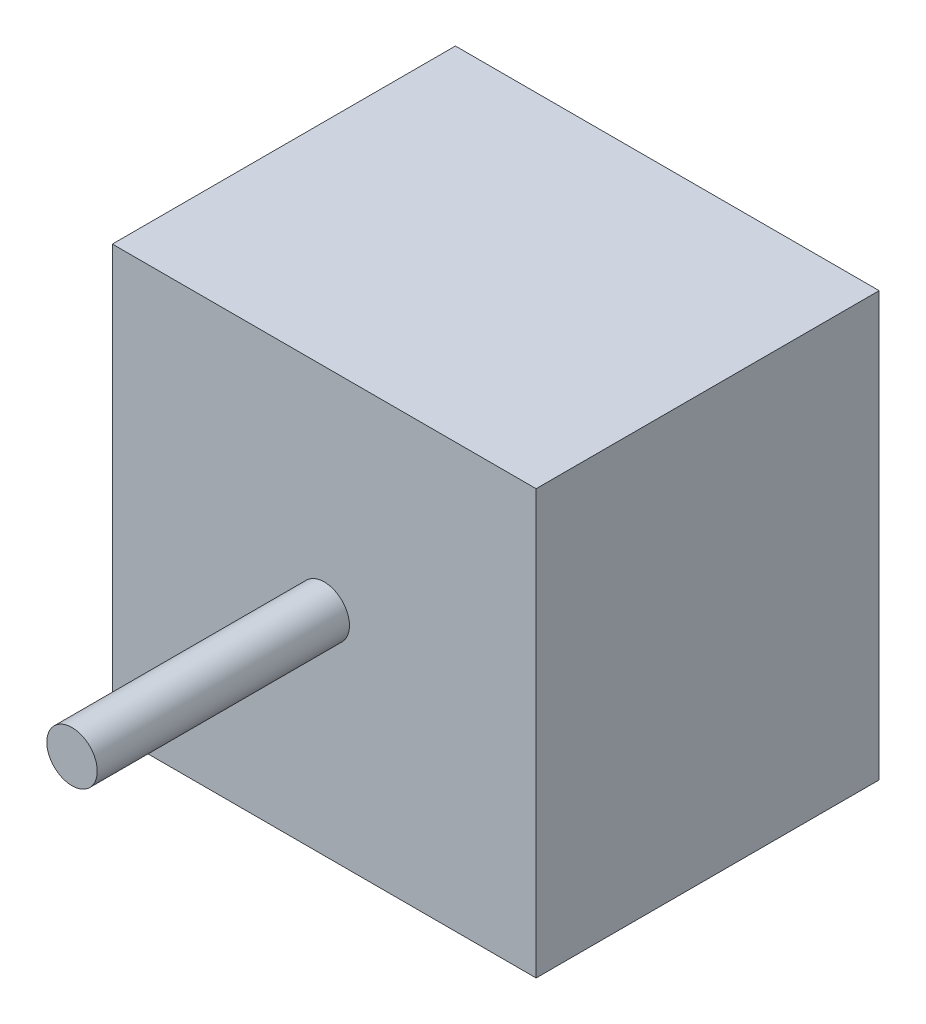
ISO-10303-21;
HEADER;
FILE_DESCRIPTION(('STEP AP214'),'2;1');
FILE_NAME('part.step','',(''),(''),'','','');
FILE_SCHEMA(('AUTOMOTIVE_DESIGN { 1 0 10303 214 1 1 1 1 }'));
ENDSEC;
DATA;
#1=APPLICATION_CONTEXT('core data for automotive mechanical design processes');
#2=APPLICATION_PROTOCOL_DEFINITION('international standard','automotive_design',2000,#1);
#3=PRODUCT_CONTEXT('',#1,'mechanical');
#4=PRODUCT('Part','Part','',(#3));
#5=PRODUCT_RELATED_PRODUCT_CATEGORY('part','',(#4));
#6=PRODUCT_DEFINITION_FORMATION('','',#4);
#7=PRODUCT_DEFINITION_CONTEXT('part definition',#1,'design');
#8=PRODUCT_DEFINITION('design','',#6,#7);
#9=PRODUCT_DEFINITION_SHAPE('','',#8);
#10=(LENGTH_UNIT() NAMED_UNIT(*) SI_UNIT(.MILLI.,.METRE.));
#11=(NAMED_UNIT(*) PLANE_ANGLE_UNIT() SI_UNIT($,.RADIAN.));
#12=(NAMED_UNIT(*) SI_UNIT($,.STERADIAN.) SOLID_ANGLE_UNIT());
#13=UNCERTAINTY_MEASURE_WITH_UNIT(LENGTH_MEASURE(1.E-05),#10,'distance_accuracy_value','');
#14=(GEOMETRIC_REPRESENTATION_CONTEXT(3) GLOBAL_UNCERTAINTY_ASSIGNED_CONTEXT((#13)) GLOBAL_UNIT_ASSIGNED_CONTEXT((#10,
#11,#12)) REPRESENTATION_CONTEXT('',''));
#15=CARTESIAN_POINT('',(0.,0.,0.));
#16=DIRECTION('',(0.,0.,1.));
#17=DIRECTION('',(1.,0.,0.));
#18=AXIS2_PLACEMENT_3D('',#15,#16,#17);
#19=CARTESIAN_POINT('',(21.,-21.,-34.));
#20=DIRECTION('',(1.,0.,0.));
#21=DIRECTION('',(0.,0.,-1.));
#22=AXIS2_PLACEMENT_3D('',#19,#20,#21);
#23=PLANE('',#22);
#24=DIRECTION('',(0.,1.,0.));
#25=VECTOR('',#24,1.);
#26=CARTESIAN_POINT('',(21.,-21.,0.));
#27=LINE('',#26,#25);
#28=CARTESIAN_POINT('',(21.,-21.,0.));
#29=VERTEX_POINT('',#28);
#30=CARTESIAN_POINT('',(21.,21.,0.));
#31=VERTEX_POINT('',#30);
#32=EDGE_CURVE('E104',#29,#31,#27,.T.);
#33=ORIENTED_EDGE('',*,*,#32,.F.);
#34=DIRECTION('',(0.,0.,1.));
#35=VECTOR('',#34,1.);
#36=CARTESIAN_POINT('',(21.,-21.,-34.));
#37=LINE('',#36,#35);
#38=CARTESIAN_POINT('',(21.,-21.,-34.));
#39=VERTEX_POINT('',#38);
#40=EDGE_CURVE('E48',#39,#29,#37,.T.);
#41=ORIENTED_EDGE('',*,*,#40,.F.);
#42=DIRECTION('',(0.,1.,0.));
#43=VECTOR('',#42,1.);
#44=CARTESIAN_POINT('',(21.,-21.,-34.));
#45=LINE('',#44,#43);
#46=CARTESIAN_POINT('',(21.,21.,-34.));
#47=VERTEX_POINT('',#46);
#48=EDGE_CURVE('E97',#39,#47,#45,.T.);
#49=ORIENTED_EDGE('',*,*,#48,.T.);
#50=DIRECTION('',(0.,0.,1.));
#51=VECTOR('',#50,1.);
#52=CARTESIAN_POINT('',(21.,21.,-34.));
#53=LINE('',#52,#51);
#54=EDGE_CURVE('E45',#47,#31,#53,.T.);
#55=ORIENTED_EDGE('',*,*,#54,.T.);
#56=EDGE_LOOP('',(#33,#41,#49,#55));
#57=FACE_BOUND('',#56,.T.);
#58=ADVANCED_FACE('F39',(#57),#23,.T.);
#59=CARTESIAN_POINT('',(-21.,-21.,-34.));
#60=DIRECTION('',(0.,-1.,0.));
#61=DIRECTION('',(0.,0.,-1.));
#62=AXIS2_PLACEMENT_3D('',#59,#60,#61);
#63=PLANE('',#62);
#64=DIRECTION('',(1.,0.,0.));
#65=VECTOR('',#64,1.);
#66=CARTESIAN_POINT('',(-21.,-21.,0.));
#67=LINE('',#66,#65);
#68=CARTESIAN_POINT('',(-21.,-21.,0.));
#69=VERTEX_POINT('',#68);
#70=EDGE_CURVE('E101',#69,#29,#67,.T.);
#71=ORIENTED_EDGE('',*,*,#70,.F.);
#72=DIRECTION('',(0.,0.,1.));
#73=VECTOR('',#72,1.);
#74=CARTESIAN_POINT('',(-21.,-21.,-34.));
#75=LINE('',#74,#73);
#76=CARTESIAN_POINT('',(-21.,-21.,-34.));
#77=VERTEX_POINT('',#76);
#78=EDGE_CURVE('E71',#77,#69,#75,.T.);
#79=ORIENTED_EDGE('',*,*,#78,.F.);
#80=DIRECTION('',(1.,0.,0.));
#81=VECTOR('',#80,1.);
#82=CARTESIAN_POINT('',(-21.,-21.,-34.));
#83=LINE('',#82,#81);
#84=EDGE_CURVE('E96',#77,#39,#83,.T.);
#85=ORIENTED_EDGE('',*,*,#84,.T.);
#86=ORIENTED_EDGE('',*,*,#40,.T.);
#87=EDGE_LOOP('',(#71,#79,#85,#86));
#88=FACE_BOUND('',#87,.T.);
#89=ADVANCED_FACE('F120',(#88),#63,.T.);
#90=CARTESIAN_POINT('',(-21.,-21.,-34.));
#91=DIRECTION('',(-1.,0.,0.));
#92=DIRECTION('',(0.,0.,1.));
#93=AXIS2_PLACEMENT_3D('',#90,#91,#92);
#94=PLANE('',#93);
#95=DIRECTION('',(0.,-1.,0.));
#96=VECTOR('',#95,1.);
#97=CARTESIAN_POINT('',(-21.,-21.,0.));
#98=LINE('',#97,#96);
#99=CARTESIAN_POINT('',(-21.,21.,0.));
#100=VERTEX_POINT('',#99);
#101=EDGE_CURVE('E93',#100,#69,#98,.T.);
#102=ORIENTED_EDGE('',*,*,#101,.F.);
#103=DIRECTION('',(0.,0.,1.));
#104=VECTOR('',#103,1.);
#105=CARTESIAN_POINT('',(-21.,21.,-34.));
#106=LINE('',#105,#104);
#107=CARTESIAN_POINT('',(-21.,21.,-34.));
#108=VERTEX_POINT('',#107);
#109=EDGE_CURVE('E88',#108,#100,#106,.T.);
#110=ORIENTED_EDGE('',*,*,#109,.F.);
#111=DIRECTION('',(0.,-1.,0.));
#112=VECTOR('',#111,1.);
#113=CARTESIAN_POINT('',(-21.,-21.,-34.));
#114=LINE('',#113,#112);
#115=EDGE_CURVE('E90',#108,#77,#114,.T.);
#116=ORIENTED_EDGE('',*,*,#115,.T.);
#117=ORIENTED_EDGE('',*,*,#78,.T.);
#118=EDGE_LOOP('',(#102,#110,#116,#117));
#119=FACE_BOUND('',#118,.T.);
#120=ADVANCED_FACE('F86',(#119),#94,.T.);
#121=CARTESIAN_POINT('',(-21.,21.,-34.));
#122=DIRECTION('',(0.,1.,0.));
#123=DIRECTION('',(0.,0.,1.));
#124=AXIS2_PLACEMENT_3D('',#121,#122,#123);
#125=PLANE('',#124);
#126=DIRECTION('',(-1.,0.,0.));
#127=VECTOR('',#126,1.);
#128=CARTESIAN_POINT('',(-21.,21.,0.));
#129=LINE('',#128,#127);
#130=EDGE_CURVE('E107',#31,#100,#129,.T.);
#131=ORIENTED_EDGE('',*,*,#130,.F.);
#132=ORIENTED_EDGE('',*,*,#54,.F.);
#133=DIRECTION('',(-1.,0.,0.));
#134=VECTOR('',#133,1.);
#135=CARTESIAN_POINT('',(-21.,21.,-34.));
#136=LINE('',#135,#134);
#137=EDGE_CURVE('E92',#47,#108,#136,.T.);
#138=ORIENTED_EDGE('',*,*,#137,.T.);
#139=ORIENTED_EDGE('',*,*,#109,.T.);
#140=EDGE_LOOP('',(#131,#132,#138,#139));
#141=FACE_BOUND('',#140,.T.);
#142=ADVANCED_FACE('F98',(#141),#125,.T.);
#143=CARTESIAN_POINT('',(0.,0.,-34.));
#144=DIRECTION('',(0.,0.,-1.));
#145=DIRECTION('',(-1.,0.,0.));
#146=AXIS2_PLACEMENT_3D('',#143,#144,#145);
#147=PLANE('',#146);
#148=ORIENTED_EDGE('',*,*,#48,.F.);
#149=ORIENTED_EDGE('',*,*,#84,.F.);
#150=ORIENTED_EDGE('',*,*,#115,.F.);
#151=ORIENTED_EDGE('',*,*,#137,.F.);
#152=EDGE_LOOP('',(#148,#149,#150,#151));
#153=FACE_BOUND('',#152,.T.);
#154=ADVANCED_FACE('F94',(#153),#147,.T.);
#155=CARTESIAN_POINT('',(0.,0.,0.));
#156=DIRECTION('',(0.,0.,-1.));
#157=DIRECTION('',(-1.,0.,0.));
#158=AXIS2_PLACEMENT_3D('',#155,#156,#157);
#159=PLANE('',#158);
#160=CARTESIAN_POINT('',(0.,0.,0.));
#161=DIRECTION('',(0.,0.,1.));
#162=DIRECTION('',(1.,0.,0.));
#163=AXIS2_PLACEMENT_3D('',#160,#161,#162);
#164=CIRCLE('',#163,2.5);
#165=CARTESIAN_POINT('',(2.5,0.,0.));
#166=VERTEX_POINT('',#165);
#167=EDGE_CURVE('E11',#166,#166,#164,.T.);
#168=ORIENTED_EDGE('',*,*,#167,.F.);
#169=EDGE_LOOP('',(#168));
#170=FACE_BOUND('',#169,.T.);
#171=ORIENTED_EDGE('',*,*,#32,.T.);
#172=ORIENTED_EDGE('',*,*,#130,.T.);
#173=ORIENTED_EDGE('',*,*,#101,.T.);
#174=ORIENTED_EDGE('',*,*,#70,.T.);
#175=EDGE_LOOP('',(#171,#172,#173,#174));
#176=FACE_BOUND('',#175,.T.);
#177=ADVANCED_FACE('F117',(#170,#176),#159,.F.);
#178=CARTESIAN_POINT('',(0.,0.,25.));
#179=DIRECTION('',(0.,0.,-1.));
#180=DIRECTION('',(-1.,0.,0.));
#181=AXIS2_PLACEMENT_3D('',#178,#179,#180);
#182=CYLINDRICAL_SURFACE('',#181,2.5);
#183=CARTESIAN_POINT('',(0.,0.,25.));
#184=DIRECTION('',(0.,0.,1.));
#185=DIRECTION('',(1.,0.,0.));
#186=AXIS2_PLACEMENT_3D('',#183,#184,#185);
#187=CIRCLE('',#186,2.5);
#188=CARTESIAN_POINT('',(2.5,0.,25.));
#189=VERTEX_POINT('',#188);
#190=EDGE_CURVE('E108',#189,#189,#187,.T.);
#191=ORIENTED_EDGE('',*,*,#190,.F.);
#192=EDGE_LOOP('',(#191));
#193=FACE_BOUND('',#192,.T.);
#194=ORIENTED_EDGE('',*,*,#167,.T.);
#195=EDGE_LOOP('',(#194));
#196=FACE_BOUND('',#195,.T.);
#197=ADVANCED_FACE('F131',(#193,#196),#182,.T.);
#198=CARTESIAN_POINT('',(0.,0.,25.));
#199=DIRECTION('',(0.,0.,1.));
#200=DIRECTION('',(1.,0.,0.));
#201=AXIS2_PLACEMENT_3D('',#198,#199,#200);
#202=PLANE('',#201);
#203=ORIENTED_EDGE('',*,*,#190,.T.);
#204=EDGE_LOOP('',(#203));
#205=FACE_BOUND('',#204,.T.);
#206=ADVANCED_FACE('F137',(#205),#202,.T.);
#207=CLOSED_SHELL('',(#58,#89,#120,#142,#154,#177,#197,#206));
#208=MANIFOLD_SOLID_BREP('B2',#207);
#209=ADVANCED_BREP_SHAPE_REPRESENTATION('',(#18,#208),#14);
#210=SHAPE_DEFINITION_REPRESENTATION(#9,#209);
ENDSEC;
END-ISO-10303-21;
